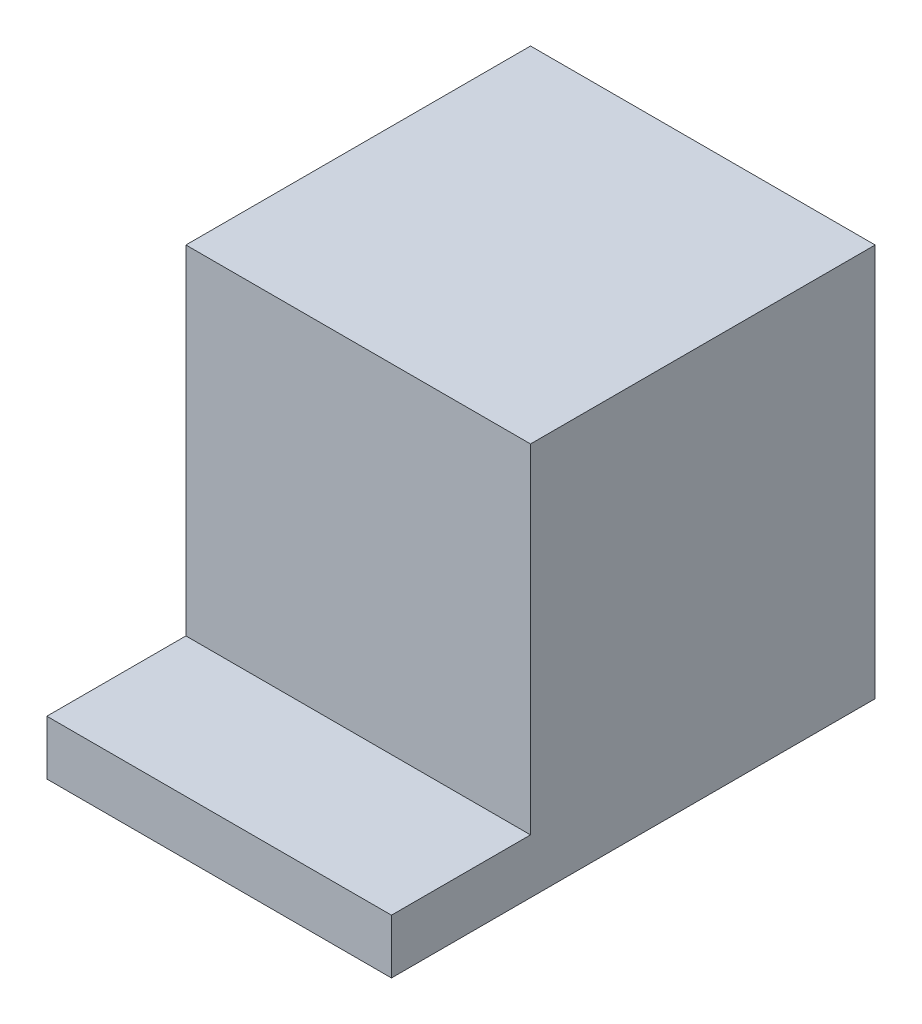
from build123d import *

# Parameters (mm, degrees)
SKETCH1_W           = 57
SKETCH1_H           = 80
BOSS_EXTRUDE1_DEPTH = 9
SKETCH2_W           = 57
SKETCH2_H           = 57
BOSS_EXTRUDE2_DEPTH = 56


with BuildPart() as part:
    # Sketch1 → Boss-Extrude1 (new body)
    with BuildSketch(Plane(origin=(0, 0, 0), x_dir=(1, 0, 0), z_dir=(0, 1, 0))):
        with Locations((28.5, 40)):
            Rectangle(SKETCH1_W, SKETCH1_H)
    extrude(amount=BOSS_EXTRUDE1_DEPTH)

    # Sketch2 → Boss-Extrude2 (add)
    with BuildSketch(Plane(origin=(0, 9, 0), x_dir=(1, 0, 0), z_dir=(0, 1, 0))):
        with Locations((28.5, 51.5)):
            Rectangle(SKETCH2_W, SKETCH2_H)
    extrude(amount=BOSS_EXTRUDE2_DEPTH)


solid = part.part
